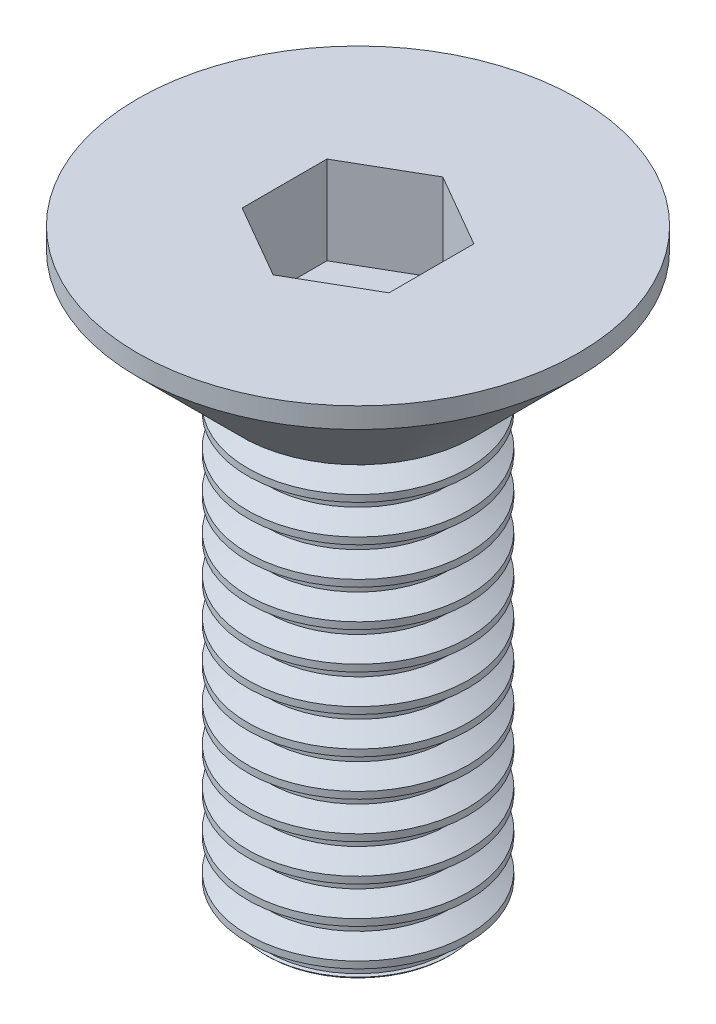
ISO-10303-21;
HEADER;
FILE_DESCRIPTION(('STEP AP214'),'2;1');
FILE_NAME('part.step','',(''),(''),'','','');
FILE_SCHEMA(('AUTOMOTIVE_DESIGN { 1 0 10303 214 1 1 1 1 }'));
ENDSEC;
DATA;
#1=APPLICATION_CONTEXT('core data for automotive mechanical design processes');
#2=APPLICATION_PROTOCOL_DEFINITION('international standard','automotive_design',2000,#1);
#3=PRODUCT_CONTEXT('',#1,'mechanical');
#4=PRODUCT('Part','Part','',(#3));
#5=PRODUCT_RELATED_PRODUCT_CATEGORY('part','',(#4));
#6=PRODUCT_DEFINITION_FORMATION('','',#4);
#7=PRODUCT_DEFINITION_CONTEXT('part definition',#1,'design');
#8=PRODUCT_DEFINITION('design','',#6,#7);
#9=PRODUCT_DEFINITION_SHAPE('','',#8);
#10=(LENGTH_UNIT() NAMED_UNIT(*) SI_UNIT(.MILLI.,.METRE.));
#11=(NAMED_UNIT(*) PLANE_ANGLE_UNIT() SI_UNIT($,.RADIAN.));
#12=(NAMED_UNIT(*) SI_UNIT($,.STERADIAN.) SOLID_ANGLE_UNIT());
#13=UNCERTAINTY_MEASURE_WITH_UNIT(LENGTH_MEASURE(1.E-05),#10,'distance_accuracy_value','');
#14=(GEOMETRIC_REPRESENTATION_CONTEXT(3) GLOBAL_UNCERTAINTY_ASSIGNED_CONTEXT((#13)) GLOBAL_UNIT_ASSIGNED_CONTEXT((#10,
#11,#12)) REPRESENTATION_CONTEXT('',''));
#15=CARTESIAN_POINT('',(0.,0.,0.));
#16=DIRECTION('',(0.,0.,1.));
#17=DIRECTION('',(1.,0.,0.));
#18=AXIS2_PLACEMENT_3D('',#15,#16,#17);
#19=CARTESIAN_POINT('',(0.,0.,0.));
#20=DIRECTION('',(0.,-1.,0.));
#21=DIRECTION('',(1.,0.,0.));
#22=AXIS2_PLACEMENT_3D('',#19,#20,#21);
#23=PLANE('',#22);
#24=DIRECTION('',(0.866025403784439,0.,0.5));
#25=VECTOR('',#24,1.);
#26=CARTESIAN_POINT('',(-1.,0.,0.577350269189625));
#27=LINE('',#26,#25);
#28=CARTESIAN_POINT('',(-1.,0.,0.577350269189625));
#29=VERTEX_POINT('',#28);
#30=CARTESIAN_POINT('',(0.,0.,1.15470053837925));
#31=VERTEX_POINT('',#30);
#32=EDGE_CURVE('E120',#29,#31,#27,.T.);
#33=ORIENTED_EDGE('',*,*,#32,.F.);
#34=DIRECTION('',(0.,0.,1.));
#35=VECTOR('',#34,1.);
#36=CARTESIAN_POINT('',(-1.,0.,-0.577350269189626));
#37=LINE('',#36,#35);
#38=CARTESIAN_POINT('',(-1.,0.,-0.577350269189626));
#39=VERTEX_POINT('',#38);
#40=EDGE_CURVE('E114',#39,#29,#37,.T.);
#41=ORIENTED_EDGE('',*,*,#40,.F.);
#42=DIRECTION('',(-0.866025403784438,0.,0.5));
#43=VECTOR('',#42,1.);
#44=CARTESIAN_POINT('',(0.,0.,-1.15470053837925));
#45=LINE('',#44,#43);
#46=CARTESIAN_POINT('',(0.,0.,-1.15470053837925));
#47=VERTEX_POINT('',#46);
#48=EDGE_CURVE('E112',#47,#39,#45,.T.);
#49=ORIENTED_EDGE('',*,*,#48,.F.);
#50=DIRECTION('',(-0.866025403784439,0.,-0.5));
#51=VECTOR('',#50,1.);
#52=CARTESIAN_POINT('',(1.,0.,-0.577350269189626));
#53=LINE('',#52,#51);
#54=CARTESIAN_POINT('',(1.,0.,-0.577350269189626));
#55=VERTEX_POINT('',#54);
#56=EDGE_CURVE('E93',#55,#47,#53,.T.);
#57=ORIENTED_EDGE('',*,*,#56,.F.);
#58=DIRECTION('',(0.,0.,-1.));
#59=VECTOR('',#58,1.);
#60=CARTESIAN_POINT('',(1.,0.,0.577350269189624));
#61=LINE('',#60,#59);
#62=CARTESIAN_POINT('',(1.,0.,0.577350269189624));
#63=VERTEX_POINT('',#62);
#64=EDGE_CURVE('E104',#63,#55,#61,.T.);
#65=ORIENTED_EDGE('',*,*,#64,.F.);
#66=DIRECTION('',(0.866025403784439,0.,-0.5));
#67=VECTOR('',#66,1.);
#68=CARTESIAN_POINT('',(0.,0.,1.15470053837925));
#69=LINE('',#68,#67);
#70=EDGE_CURVE('E50',#31,#63,#69,.T.);
#71=ORIENTED_EDGE('',*,*,#70,.F.);
#72=EDGE_LOOP('',(#33,#41,#49,#57,#65,#71));
#73=FACE_BOUND('',#72,.T.);
#74=CARTESIAN_POINT('',(0.,0.,0.));
#75=DIRECTION('',(0.,1.,0.));
#76=DIRECTION('',(-1.,0.,0.));
#77=AXIS2_PLACEMENT_3D('',#74,#75,#76);
#78=CIRCLE('',#77,3.);
#79=CARTESIAN_POINT('',(-3.,0.,0.));
#80=VERTEX_POINT('',#79);
#81=EDGE_CURVE('E11',#80,#80,#78,.T.);
#82=ORIENTED_EDGE('',*,*,#81,.T.);
#83=EDGE_LOOP('',(#82));
#84=FACE_BOUND('',#83,.T.);
#85=ADVANCED_FACE('F35',(#73,#84),#23,.F.);
#86=CARTESIAN_POINT('',(0.,0.,0.));
#87=DIRECTION('',(0.,1.,0.));
#88=DIRECTION('',(-1.,0.,0.));
#89=AXIS2_PLACEMENT_3D('',#86,#87,#88);
#90=CYLINDRICAL_SURFACE('',#89,3.);
#91=ORIENTED_EDGE('',*,*,#81,.F.);
#92=EDGE_LOOP('',(#91));
#93=FACE_BOUND('',#92,.T.);
#94=CARTESIAN_POINT('',(0.,-0.280000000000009,0.));
#95=DIRECTION('',(0.,1.,0.));
#96=DIRECTION('',(-1.,0.,0.));
#97=AXIS2_PLACEMENT_3D('',#94,#95,#96);
#98=CIRCLE('',#97,3.);
#99=CARTESIAN_POINT('',(-3.,-0.28000000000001,0.));
#100=VERTEX_POINT('',#99);
#101=EDGE_CURVE('E43',#100,#100,#98,.T.);
#102=ORIENTED_EDGE('',*,*,#101,.T.);
#103=EDGE_LOOP('',(#102));
#104=FACE_BOUND('',#103,.T.);
#105=ADVANCED_FACE('F154',(#93,#104),#90,.T.);
#106=CARTESIAN_POINT('',(0.,-1.69999999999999,0.));
#107=DIRECTION('',(0.,1.,0.));
#108=DIRECTION('',(-1.,0.,0.));
#109=AXIS2_PLACEMENT_3D('',#106,#107,#108);
#110=CONICAL_SURFACE('',#109,1.58000000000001,0.78539816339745);
#111=ORIENTED_EDGE('',*,*,#101,.F.);
#112=EDGE_LOOP('',(#111));
#113=FACE_BOUND('',#112,.T.);
#114=CARTESIAN_POINT('',(0.,-1.69999999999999,0.));
#115=DIRECTION('',(0.,1.,0.));
#116=DIRECTION('',(-1.,0.,0.));
#117=AXIS2_PLACEMENT_3D('',#114,#115,#116);
#118=CIRCLE('',#117,1.58000000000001);
#119=CARTESIAN_POINT('',(-1.58000000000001,-1.69999999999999,0.));
#120=VERTEX_POINT('',#119);
#121=EDGE_CURVE('E148',#120,#120,#118,.T.);
#122=ORIENTED_EDGE('',*,*,#121,.T.);
#123=EDGE_LOOP('',(#122));
#124=FACE_BOUND('',#123,.T.);
#125=ADVANCED_FACE('F156',(#113,#124),#110,.T.);
#126=CARTESIAN_POINT('',(1.50000000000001,-1.69999999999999,0.));
#127=DIRECTION('',(0.,1.,0.));
#128=DIRECTION('',(-1.,0.,0.));
#129=AXIS2_PLACEMENT_3D('',#126,#127,#128);
#130=PLANE('',#129);
#131=ORIENTED_EDGE('',*,*,#121,.F.);
#132=EDGE_LOOP('',(#131));
#133=FACE_BOUND('',#132,.T.);
#134=CARTESIAN_POINT('',(0.,-1.69999999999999,0.));
#135=DIRECTION('',(0.,-1.,0.));
#136=DIRECTION('',(1.,0.,0.));
#137=AXIS2_PLACEMENT_3D('',#134,#135,#136);
#138=CIRCLE('',#137,1.50000000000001);
#139=CARTESIAN_POINT('',(1.50000000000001,-1.69999999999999,0.));
#140=VERTEX_POINT('',#139);
#141=EDGE_CURVE('E169',#140,#140,#138,.T.);
#142=ORIENTED_EDGE('',*,*,#141,.F.);
#143=EDGE_LOOP('',(#142));
#144=FACE_BOUND('',#143,.T.);
#145=ADVANCED_FACE('F159',(#133,#144),#130,.F.);
#146=CARTESIAN_POINT('',(0.,-1.2,1.15470053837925));
#147=DIRECTION('',(0.5,0.,0.866025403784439));
#148=DIRECTION('',(0.866025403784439,0.,-0.5));
#149=AXIS2_PLACEMENT_3D('',#146,#147,#148);
#150=PLANE('',#149);
#151=ORIENTED_EDGE('',*,*,#70,.T.);
#152=DIRECTION('',(0.,1.,0.));
#153=VECTOR('',#152,1.);
#154=CARTESIAN_POINT('',(1.,-1.2,0.577350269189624));
#155=LINE('',#154,#153);
#156=CARTESIAN_POINT('',(1.,-1.2,0.577350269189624));
#157=VERTEX_POINT('',#156);
#158=EDGE_CURVE('E101',#157,#63,#155,.T.);
#159=ORIENTED_EDGE('',*,*,#158,.F.);
#160=DIRECTION('',(0.866025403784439,0.,-0.5));
#161=VECTOR('',#160,1.);
#162=CARTESIAN_POINT('',(0.,-1.2,1.15470053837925));
#163=LINE('',#162,#161);
#164=CARTESIAN_POINT('',(0.,-1.2,1.15470053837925));
#165=VERTEX_POINT('',#164);
#166=EDGE_CURVE('E122',#165,#157,#163,.T.);
#167=ORIENTED_EDGE('',*,*,#166,.F.);
#168=DIRECTION('',(0.,1.,0.));
#169=VECTOR('',#168,1.);
#170=CARTESIAN_POINT('',(0.,-1.2,1.15470053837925));
#171=LINE('',#170,#169);
#172=EDGE_CURVE('E57',#165,#31,#171,.T.);
#173=ORIENTED_EDGE('',*,*,#172,.T.);
#174=EDGE_LOOP('',(#151,#159,#167,#173));
#175=FACE_BOUND('',#174,.T.);
#176=ADVANCED_FACE('F165',(#175),#150,.F.);
#177=CARTESIAN_POINT('',(-1.,-1.2,0.577350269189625));
#178=DIRECTION('',(-0.5,0.,0.866025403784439));
#179=DIRECTION('',(0.866025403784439,0.,0.5));
#180=AXIS2_PLACEMENT_3D('',#177,#178,#179);
#181=PLANE('',#180);
#182=ORIENTED_EDGE('',*,*,#32,.T.);
#183=ORIENTED_EDGE('',*,*,#172,.F.);
#184=DIRECTION('',(0.866025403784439,0.,0.5));
#185=VECTOR('',#184,1.);
#186=CARTESIAN_POINT('',(-1.,-1.2,0.577350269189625));
#187=LINE('',#186,#185);
#188=CARTESIAN_POINT('',(-1.,-1.2,0.577350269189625));
#189=VERTEX_POINT('',#188);
#190=EDGE_CURVE('E134',#189,#165,#187,.T.);
#191=ORIENTED_EDGE('',*,*,#190,.F.);
#192=DIRECTION('',(0.,1.,0.));
#193=VECTOR('',#192,1.);
#194=CARTESIAN_POINT('',(-1.,-1.2,0.577350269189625));
#195=LINE('',#194,#193);
#196=EDGE_CURVE('E139',#189,#29,#195,.T.);
#197=ORIENTED_EDGE('',*,*,#196,.T.);
#198=EDGE_LOOP('',(#182,#183,#191,#197));
#199=FACE_BOUND('',#198,.T.);
#200=ADVANCED_FACE('F235',(#199),#181,.F.);
#201=CARTESIAN_POINT('',(-1.,-1.2,-0.577350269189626));
#202=DIRECTION('',(-1.,0.,0.));
#203=DIRECTION('',(0.,0.,1.));
#204=AXIS2_PLACEMENT_3D('',#201,#202,#203);
#205=PLANE('',#204);
#206=ORIENTED_EDGE('',*,*,#40,.T.);
#207=ORIENTED_EDGE('',*,*,#196,.F.);
#208=DIRECTION('',(0.,0.,1.));
#209=VECTOR('',#208,1.);
#210=CARTESIAN_POINT('',(-1.,-1.2,-0.577350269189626));
#211=LINE('',#210,#209);
#212=CARTESIAN_POINT('',(-1.,-1.2,-0.577350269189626));
#213=VERTEX_POINT('',#212);
#214=EDGE_CURVE('E131',#213,#189,#211,.T.);
#215=ORIENTED_EDGE('',*,*,#214,.F.);
#216=DIRECTION('',(0.,1.,0.));
#217=VECTOR('',#216,1.);
#218=CARTESIAN_POINT('',(-1.,-1.2,-0.577350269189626));
#219=LINE('',#218,#217);
#220=EDGE_CURVE('E141',#213,#39,#219,.T.);
#221=ORIENTED_EDGE('',*,*,#220,.T.);
#222=EDGE_LOOP('',(#206,#207,#215,#221));
#223=FACE_BOUND('',#222,.T.);
#224=ADVANCED_FACE('F243',(#223),#205,.F.);
#225=CARTESIAN_POINT('',(0.,-1.2,-1.15470053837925));
#226=DIRECTION('',(-0.5,0.,-0.866025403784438));
#227=DIRECTION('',(-0.866025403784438,0.,0.5));
#228=AXIS2_PLACEMENT_3D('',#225,#226,#227);
#229=PLANE('',#228);
#230=ORIENTED_EDGE('',*,*,#48,.T.);
#231=ORIENTED_EDGE('',*,*,#220,.F.);
#232=DIRECTION('',(-0.866025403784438,0.,0.5));
#233=VECTOR('',#232,1.);
#234=CARTESIAN_POINT('',(0.,-1.2,-1.15470053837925));
#235=LINE('',#234,#233);
#236=CARTESIAN_POINT('',(0.,-1.2,-1.15470053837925));
#237=VERTEX_POINT('',#236);
#238=EDGE_CURVE('E128',#237,#213,#235,.T.);
#239=ORIENTED_EDGE('',*,*,#238,.F.);
#240=DIRECTION('',(0.,1.,0.));
#241=VECTOR('',#240,1.);
#242=CARTESIAN_POINT('',(0.,-1.2,-1.15470053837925));
#243=LINE('',#242,#241);
#244=EDGE_CURVE('E100',#237,#47,#243,.T.);
#245=ORIENTED_EDGE('',*,*,#244,.T.);
#246=EDGE_LOOP('',(#230,#231,#239,#245));
#247=FACE_BOUND('',#246,.T.);
#248=ADVANCED_FACE('F240',(#247),#229,.F.);
#249=CARTESIAN_POINT('',(1.,-1.2,-0.577350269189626));
#250=DIRECTION('',(0.5,0.,-0.866025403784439));
#251=DIRECTION('',(-0.866025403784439,0.,-0.5));
#252=AXIS2_PLACEMENT_3D('',#249,#250,#251);
#253=PLANE('',#252);
#254=ORIENTED_EDGE('',*,*,#56,.T.);
#255=ORIENTED_EDGE('',*,*,#244,.F.);
#256=DIRECTION('',(-0.866025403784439,0.,-0.5));
#257=VECTOR('',#256,1.);
#258=CARTESIAN_POINT('',(1.,-1.2,-0.577350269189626));
#259=LINE('',#258,#257);
#260=CARTESIAN_POINT('',(1.,-1.2,-0.577350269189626));
#261=VERTEX_POINT('',#260);
#262=EDGE_CURVE('E96',#261,#237,#259,.T.);
#263=ORIENTED_EDGE('',*,*,#262,.F.);
#264=DIRECTION('',(0.,1.,0.));
#265=VECTOR('',#264,1.);
#266=CARTESIAN_POINT('',(1.,-1.2,-0.577350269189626));
#267=LINE('',#266,#265);
#268=EDGE_CURVE('E89',#261,#55,#267,.T.);
#269=ORIENTED_EDGE('',*,*,#268,.T.);
#270=EDGE_LOOP('',(#254,#255,#263,#269));
#271=FACE_BOUND('',#270,.T.);
#272=ADVANCED_FACE('F91',(#271),#253,.F.);
#273=CARTESIAN_POINT('',(1.,-1.2,0.577350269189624));
#274=DIRECTION('',(1.,0.,0.));
#275=DIRECTION('',(0.,0.,-1.));
#276=AXIS2_PLACEMENT_3D('',#273,#274,#275);
#277=PLANE('',#276);
#278=ORIENTED_EDGE('',*,*,#64,.T.);
#279=ORIENTED_EDGE('',*,*,#268,.F.);
#280=DIRECTION('',(0.,0.,-1.));
#281=VECTOR('',#280,1.);
#282=CARTESIAN_POINT('',(1.,-1.2,0.577350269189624));
#283=LINE('',#282,#281);
#284=EDGE_CURVE('E125',#157,#261,#283,.T.);
#285=ORIENTED_EDGE('',*,*,#284,.F.);
#286=ORIENTED_EDGE('',*,*,#158,.T.);
#287=EDGE_LOOP('',(#278,#279,#285,#286));
#288=FACE_BOUND('',#287,.T.);
#289=ADVANCED_FACE('F105',(#288),#277,.F.);
#290=CARTESIAN_POINT('',(-1.,-1.2,1.73205080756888));
#291=DIRECTION('',(0.,-1.,0.));
#292=DIRECTION('',(0.,0.,-1.));
#293=AXIS2_PLACEMENT_3D('',#290,#291,#292);
#294=PLANE('',#293);
#295=ORIENTED_EDGE('',*,*,#166,.T.);
#296=ORIENTED_EDGE('',*,*,#284,.T.);
#297=ORIENTED_EDGE('',*,*,#262,.T.);
#298=ORIENTED_EDGE('',*,*,#238,.T.);
#299=ORIENTED_EDGE('',*,*,#214,.T.);
#300=ORIENTED_EDGE('',*,*,#190,.T.);
#301=EDGE_LOOP('',(#295,#296,#297,#298,#299,#300));
#302=FACE_BOUND('',#301,.T.);
#303=ADVANCED_FACE('F194',(#302),#294,.F.);
#304=CARTESIAN_POINT('',(0.,-1.95000000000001,0.));
#305=DIRECTION('',(0.,-1.,0.));
#306=DIRECTION('',(1.,0.,0.));
#307=AXIS2_PLACEMENT_3D('',#304,#305,#306);
#308=CONICAL_SURFACE('',#307,1.22698729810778,1.04719755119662);
#309=CARTESIAN_POINT('',(0.,-2.10762395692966,0.));
#310=DIRECTION('',(0.,-1.,0.));
#311=DIRECTION('',(1.,0.,0.));
#312=AXIS2_PLACEMENT_3D('',#309,#310,#311);
#313=CIRCLE('',#312,1.50000000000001);
#314=CARTESIAN_POINT('',(1.50000000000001,-2.10762395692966,0.));
#315=VERTEX_POINT('',#314);
#316=EDGE_CURVE('E184',#315,#315,#313,.T.);
#317=ORIENTED_EDGE('',*,*,#316,.F.);
#318=EDGE_LOOP('',(#317));
#319=FACE_BOUND('',#318,.T.);
#320=CARTESIAN_POINT('',(0.,-1.95000000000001,0.));
#321=DIRECTION('',(0.,-1.,0.));
#322=DIRECTION('',(1.,0.,0.));
#323=AXIS2_PLACEMENT_3D('',#320,#321,#322);
#324=CIRCLE('',#323,1.22698729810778);
#325=CARTESIAN_POINT('',(1.22698729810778,-1.95000000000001,0.));
#326=VERTEX_POINT('',#325);
#327=EDGE_CURVE('E175',#326,#326,#324,.T.);
#328=ORIENTED_EDGE('',*,*,#327,.T.);
#329=EDGE_LOOP('',(#328));
#330=FACE_BOUND('',#329,.T.);
#331=ADVANCED_FACE('F190',(#319,#330),#308,.T.);
#332=CARTESIAN_POINT('',(0.,-8.,0.));
#333=DIRECTION('',(0.,-1.,0.));
#334=DIRECTION('',(1.,0.,0.));
#335=AXIS2_PLACEMENT_3D('',#332,#333,#334);
#336=CYLINDRICAL_SURFACE('',#335,1.22698729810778);
#337=ORIENTED_EDGE('',*,*,#327,.F.);
#338=EDGE_LOOP('',(#337));
#339=FACE_BOUND('',#338,.T.);
#340=CARTESIAN_POINT('',(0.,-1.85762395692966,0.));
#341=DIRECTION('',(0.,-1.,0.));
#342=DIRECTION('',(1.,0.,0.));
#343=AXIS2_PLACEMENT_3D('',#340,#341,#342);
#344=CIRCLE('',#343,1.22698729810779);
#345=CARTESIAN_POINT('',(1.22698729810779,-1.85762395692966,0.));
#346=VERTEX_POINT('',#345);
#347=EDGE_CURVE('E171',#346,#346,#344,.T.);
#348=ORIENTED_EDGE('',*,*,#347,.T.);
#349=EDGE_LOOP('',(#348));
#350=FACE_BOUND('',#349,.T.);
#351=ADVANCED_FACE('F193',(#339,#350),#336,.T.);
#352=CARTESIAN_POINT('',(0.,-1.69999999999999,0.));
#353=DIRECTION('',(0.,1.,0.));
#354=DIRECTION('',(-1.,0.,0.));
#355=AXIS2_PLACEMENT_3D('',#352,#353,#354);
#356=CONICAL_SURFACE('',#355,1.50000000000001,1.04719755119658);
#357=ORIENTED_EDGE('',*,*,#347,.F.);
#358=EDGE_LOOP('',(#357));
#359=FACE_BOUND('',#358,.T.);
#360=ORIENTED_EDGE('',*,*,#141,.T.);
#361=EDGE_LOOP('',(#360));
#362=FACE_BOUND('',#361,.T.);
#363=ADVANCED_FACE('F200',(#359,#362),#356,.T.);
#364=CARTESIAN_POINT('',(0.,0.,0.));
#365=DIRECTION('',(0.,1.,0.));
#366=DIRECTION('',(-1.,0.,0.));
#367=AXIS2_PLACEMENT_3D('',#364,#365,#366);
#368=CYLINDRICAL_SURFACE('',#367,1.5);
#369=CARTESIAN_POINT('',(0.,-2.19999999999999,0.));
#370=DIRECTION('',(0.,-1.,0.));
#371=DIRECTION('',(1.,0.,0.));
#372=AXIS2_PLACEMENT_3D('',#369,#370,#371);
#373=CIRCLE('',#372,1.50000000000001);
#374=CARTESIAN_POINT('',(1.50000000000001,-2.19999999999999,0.));
#375=VERTEX_POINT('',#374);
#376=EDGE_CURVE('E949',#375,#375,#373,.T.);
#377=ORIENTED_EDGE('',*,*,#376,.F.);
#378=EDGE_LOOP('',(#377));
#379=FACE_BOUND('',#378,.T.);
#380=ORIENTED_EDGE('',*,*,#316,.T.);
#381=EDGE_LOOP('',(#380));
#382=FACE_BOUND('',#381,.T.);
#383=ADVANCED_FACE('F188',(#379,#382),#368,.T.);
#384=CARTESIAN_POINT('',(0.,-2.45000000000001,0.));
#385=DIRECTION('',(0.,-1.,0.));
#386=DIRECTION('',(1.,0.,0.));
#387=AXIS2_PLACEMENT_3D('',#384,#385,#386);
#388=CONICAL_SURFACE('',#387,1.22698729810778,1.04719755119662);
#389=CARTESIAN_POINT('',(0.,-2.60762395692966,0.));
#390=DIRECTION('',(0.,-1.,0.));
#391=DIRECTION('',(1.,0.,0.));
#392=AXIS2_PLACEMENT_3D('',#389,#390,#391);
#393=CIRCLE('',#392,1.50000000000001);
#394=CARTESIAN_POINT('',(1.50000000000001,-2.60762395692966,0.));
#395=VERTEX_POINT('',#394);
#396=EDGE_CURVE('E172',#395,#395,#393,.T.);
#397=ORIENTED_EDGE('',*,*,#396,.F.);
#398=EDGE_LOOP('',(#397));
#399=FACE_BOUND('',#398,.T.);
#400=CARTESIAN_POINT('',(0.,-2.45000000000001,0.));
#401=DIRECTION('',(0.,-1.,0.));
#402=DIRECTION('',(1.,0.,0.));
#403=AXIS2_PLACEMENT_3D('',#400,#401,#402);
#404=CIRCLE('',#403,1.22698729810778);
#405=CARTESIAN_POINT('',(1.22698729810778,-2.45000000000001,0.));
#406=VERTEX_POINT('',#405);
#407=EDGE_CURVE('E178',#406,#406,#404,.T.);
#408=ORIENTED_EDGE('',*,*,#407,.T.);
#409=EDGE_LOOP('',(#408));
#410=FACE_BOUND('',#409,.T.);
#411=ADVANCED_FACE('F209',(#399,#410),#388,.T.);
#412=CARTESIAN_POINT('',(0.,-8.5,0.));
#413=DIRECTION('',(0.,-1.,0.));
#414=DIRECTION('',(1.,0.,0.));
#415=AXIS2_PLACEMENT_3D('',#412,#413,#414);
#416=CYLINDRICAL_SURFACE('',#415,1.22698729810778);
#417=ORIENTED_EDGE('',*,*,#407,.F.);
#418=EDGE_LOOP('',(#417));
#419=FACE_BOUND('',#418,.T.);
#420=CARTESIAN_POINT('',(0.,-2.35762395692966,0.));
#421=DIRECTION('',(0.,-1.,0.));
#422=DIRECTION('',(1.,0.,0.));
#423=AXIS2_PLACEMENT_3D('',#420,#421,#422);
#424=CIRCLE('',#423,1.22698729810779);
#425=CARTESIAN_POINT('',(1.22698729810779,-2.35762395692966,0.));
#426=VERTEX_POINT('',#425);
#427=EDGE_CURVE('E952',#426,#426,#424,.T.);
#428=ORIENTED_EDGE('',*,*,#427,.T.);
#429=EDGE_LOOP('',(#428));
#430=FACE_BOUND('',#429,.T.);
#431=ADVANCED_FACE('F288',(#419,#430),#416,.T.);
#432=CARTESIAN_POINT('',(0.,-2.19999999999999,0.));
#433=DIRECTION('',(0.,1.,0.));
#434=DIRECTION('',(-1.,0.,0.));
#435=AXIS2_PLACEMENT_3D('',#432,#433,#434);
#436=CONICAL_SURFACE('',#435,1.50000000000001,1.04719755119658);
#437=ORIENTED_EDGE('',*,*,#427,.F.);
#438=EDGE_LOOP('',(#437));
#439=FACE_BOUND('',#438,.T.);
#440=ORIENTED_EDGE('',*,*,#376,.T.);
#441=EDGE_LOOP('',(#440));
#442=FACE_BOUND('',#441,.T.);
#443=ADVANCED_FACE('F298',(#439,#442),#436,.T.);
#444=CARTESIAN_POINT('',(0.,-2.69999999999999,0.));
#445=DIRECTION('',(0.,-1.,0.));
#446=DIRECTION('',(1.,0.,0.));
#447=AXIS2_PLACEMENT_3D('',#444,#445,#446);
#448=CIRCLE('',#447,1.50000000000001);
#449=CARTESIAN_POINT('',(1.50000000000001,-2.69999999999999,0.));
#450=VERTEX_POINT('',#449);
#451=EDGE_CURVE('E937',#450,#450,#448,.T.);
#452=ORIENTED_EDGE('',*,*,#451,.F.);
#453=EDGE_LOOP('',(#452));
#454=FACE_BOUND('',#453,.T.);
#455=ORIENTED_EDGE('',*,*,#396,.T.);
#456=EDGE_LOOP('',(#455));
#457=FACE_BOUND('',#456,.T.);
#458=ADVANCED_FACE('F213',(#454,#457),#368,.T.);
#459=CARTESIAN_POINT('',(0.,-2.95000000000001,0.));
#460=DIRECTION('',(0.,-1.,0.));
#461=DIRECTION('',(1.,0.,0.));
#462=AXIS2_PLACEMENT_3D('',#459,#460,#461);
#463=CONICAL_SURFACE('',#462,1.22698729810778,1.04719755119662);
#464=CARTESIAN_POINT('',(0.,-3.10762395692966,0.));
#465=DIRECTION('',(0.,-1.,0.));
#466=DIRECTION('',(1.,0.,0.));
#467=AXIS2_PLACEMENT_3D('',#464,#465,#466);
#468=CIRCLE('',#467,1.50000000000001);
#469=CARTESIAN_POINT('',(1.50000000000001,-3.10762395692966,0.));
#470=VERTEX_POINT('',#469);
#471=EDGE_CURVE('E946',#470,#470,#468,.T.);
#472=ORIENTED_EDGE('',*,*,#471,.F.);
#473=EDGE_LOOP('',(#472));
#474=FACE_BOUND('',#473,.T.);
#475=CARTESIAN_POINT('',(0.,-2.95000000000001,0.));
#476=DIRECTION('',(0.,-1.,0.));
#477=DIRECTION('',(1.,0.,0.));
#478=AXIS2_PLACEMENT_3D('',#475,#476,#477);
#479=CIRCLE('',#478,1.22698729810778);
#480=CARTESIAN_POINT('',(1.22698729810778,-2.95000000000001,0.));
#481=VERTEX_POINT('',#480);
#482=EDGE_CURVE('E943',#481,#481,#479,.T.);
#483=ORIENTED_EDGE('',*,*,#482,.T.);
#484=EDGE_LOOP('',(#483));
#485=FACE_BOUND('',#484,.T.);
#486=ADVANCED_FACE('F318',(#474,#485),#463,.T.);
#487=CARTESIAN_POINT('',(0.,-9.,0.));
#488=DIRECTION('',(0.,-1.,0.));
#489=DIRECTION('',(1.,0.,0.));
#490=AXIS2_PLACEMENT_3D('',#487,#488,#489);
#491=CYLINDRICAL_SURFACE('',#490,1.22698729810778);
#492=ORIENTED_EDGE('',*,*,#482,.F.);
#493=EDGE_LOOP('',(#492));
#494=FACE_BOUND('',#493,.T.);
#495=CARTESIAN_POINT('',(0.,-2.85762395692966,0.));
#496=DIRECTION('',(0.,-1.,0.));
#497=DIRECTION('',(1.,0.,0.));
#498=AXIS2_PLACEMENT_3D('',#495,#496,#497);
#499=CIRCLE('',#498,1.22698729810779);
#500=CARTESIAN_POINT('',(1.22698729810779,-2.85762395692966,0.));
#501=VERTEX_POINT('',#500);
#502=EDGE_CURVE('E940',#501,#501,#499,.T.);
#503=ORIENTED_EDGE('',*,*,#502,.T.);
#504=EDGE_LOOP('',(#503));
#505=FACE_BOUND('',#504,.T.);
#506=ADVANCED_FACE('F328',(#494,#505),#491,.T.);
#507=CARTESIAN_POINT('',(0.,-2.69999999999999,0.));
#508=DIRECTION('',(0.,1.,0.));
#509=DIRECTION('',(-1.,0.,0.));
#510=AXIS2_PLACEMENT_3D('',#507,#508,#509);
#511=CONICAL_SURFACE('',#510,1.50000000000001,1.04719755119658);
#512=ORIENTED_EDGE('',*,*,#502,.F.);
#513=EDGE_LOOP('',(#512));
#514=FACE_BOUND('',#513,.T.);
#515=ORIENTED_EDGE('',*,*,#451,.T.);
#516=EDGE_LOOP('',(#515));
#517=FACE_BOUND('',#516,.T.);
#518=ADVANCED_FACE('F338',(#514,#517),#511,.T.);
#519=CARTESIAN_POINT('',(0.,-3.19999999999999,0.));
#520=DIRECTION('',(0.,-1.,0.));
#521=DIRECTION('',(1.,0.,0.));
#522=AXIS2_PLACEMENT_3D('',#519,#520,#521);
#523=CIRCLE('',#522,1.50000000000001);
#524=CARTESIAN_POINT('',(1.50000000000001,-3.19999999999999,0.));
#525=VERTEX_POINT('',#524);
#526=EDGE_CURVE('E925',#525,#525,#523,.T.);
#527=ORIENTED_EDGE('',*,*,#526,.F.);
#528=EDGE_LOOP('',(#527));
#529=FACE_BOUND('',#528,.T.);
#530=ORIENTED_EDGE('',*,*,#471,.T.);
#531=EDGE_LOOP('',(#530));
#532=FACE_BOUND('',#531,.T.);
#533=ADVANCED_FACE('F320',(#529,#532),#368,.T.);
#534=CARTESIAN_POINT('',(0.,-3.45000000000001,0.));
#535=DIRECTION('',(0.,-1.,0.));
#536=DIRECTION('',(1.,0.,0.));
#537=AXIS2_PLACEMENT_3D('',#534,#535,#536);
#538=CONICAL_SURFACE('',#537,1.22698729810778,1.04719755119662);
#539=CARTESIAN_POINT('',(0.,-3.60762395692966,0.));
#540=DIRECTION('',(0.,-1.,0.));
#541=DIRECTION('',(1.,0.,0.));
#542=AXIS2_PLACEMENT_3D('',#539,#540,#541);
#543=CIRCLE('',#542,1.50000000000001);
#544=CARTESIAN_POINT('',(1.50000000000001,-3.60762395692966,0.));
#545=VERTEX_POINT('',#544);
#546=EDGE_CURVE('E934',#545,#545,#543,.T.);
#547=ORIENTED_EDGE('',*,*,#546,.F.);
#548=EDGE_LOOP('',(#547));
#549=FACE_BOUND('',#548,.T.);
#550=CARTESIAN_POINT('',(0.,-3.45000000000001,0.));
#551=DIRECTION('',(0.,-1.,0.));
#552=DIRECTION('',(1.,0.,0.));
#553=AXIS2_PLACEMENT_3D('',#550,#551,#552);
#554=CIRCLE('',#553,1.22698729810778);
#555=CARTESIAN_POINT('',(1.22698729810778,-3.45000000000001,0.));
#556=VERTEX_POINT('',#555);
#557=EDGE_CURVE('E931',#556,#556,#554,.T.);
#558=ORIENTED_EDGE('',*,*,#557,.T.);
#559=EDGE_LOOP('',(#558));
#560=FACE_BOUND('',#559,.T.);
#561=ADVANCED_FACE('F357',(#549,#560),#538,.T.);
#562=CARTESIAN_POINT('',(0.,-9.5,0.));
#563=DIRECTION('',(0.,-1.,0.));
#564=DIRECTION('',(1.,0.,0.));
#565=AXIS2_PLACEMENT_3D('',#562,#563,#564);
#566=CYLINDRICAL_SURFACE('',#565,1.22698729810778);
#567=ORIENTED_EDGE('',*,*,#557,.F.);
#568=EDGE_LOOP('',(#567));
#569=FACE_BOUND('',#568,.T.);
#570=CARTESIAN_POINT('',(0.,-3.35762395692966,0.));
#571=DIRECTION('',(0.,-1.,0.));
#572=DIRECTION('',(1.,0.,0.));
#573=AXIS2_PLACEMENT_3D('',#570,#571,#572);
#574=CIRCLE('',#573,1.22698729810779);
#575=CARTESIAN_POINT('',(1.22698729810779,-3.35762395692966,0.));
#576=VERTEX_POINT('',#575);
#577=EDGE_CURVE('E928',#576,#576,#574,.T.);
#578=ORIENTED_EDGE('',*,*,#577,.T.);
#579=EDGE_LOOP('',(#578));
#580=FACE_BOUND('',#579,.T.);
#581=ADVANCED_FACE('F367',(#569,#580),#566,.T.);
#582=CARTESIAN_POINT('',(0.,-3.19999999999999,0.));
#583=DIRECTION('',(0.,1.,0.));
#584=DIRECTION('',(-1.,0.,0.));
#585=AXIS2_PLACEMENT_3D('',#582,#583,#584);
#586=CONICAL_SURFACE('',#585,1.50000000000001,1.04719755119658);
#587=ORIENTED_EDGE('',*,*,#577,.F.);
#588=EDGE_LOOP('',(#587));
#589=FACE_BOUND('',#588,.T.);
#590=ORIENTED_EDGE('',*,*,#526,.T.);
#591=EDGE_LOOP('',(#590));
#592=FACE_BOUND('',#591,.T.);
#593=ADVANCED_FACE('F377',(#589,#592),#586,.T.);
#594=CARTESIAN_POINT('',(0.,-3.69999999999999,0.));
#595=DIRECTION('',(0.,-1.,0.));
#596=DIRECTION('',(1.,0.,0.));
#597=AXIS2_PLACEMENT_3D('',#594,#595,#596);
#598=CIRCLE('',#597,1.50000000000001);
#599=CARTESIAN_POINT('',(1.50000000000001,-3.69999999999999,0.));
#600=VERTEX_POINT('',#599);
#601=EDGE_CURVE('E913',#600,#600,#598,.T.);
#602=ORIENTED_EDGE('',*,*,#601,.F.);
#603=EDGE_LOOP('',(#602));
#604=FACE_BOUND('',#603,.T.);
#605=ORIENTED_EDGE('',*,*,#546,.T.);
#606=EDGE_LOOP('',(#605));
#607=FACE_BOUND('',#606,.T.);
#608=ADVANCED_FACE('F359',(#604,#607),#368,.T.);
#609=CARTESIAN_POINT('',(0.,-3.95000000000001,0.));
#610=DIRECTION('',(0.,-1.,0.));
#611=DIRECTION('',(1.,0.,0.));
#612=AXIS2_PLACEMENT_3D('',#609,#610,#611);
#613=CONICAL_SURFACE('',#612,1.22698729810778,1.04719755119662);
#614=CARTESIAN_POINT('',(0.,-4.10762395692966,0.));
#615=DIRECTION('',(0.,-1.,0.));
#616=DIRECTION('',(1.,0.,0.));
#617=AXIS2_PLACEMENT_3D('',#614,#615,#616);
#618=CIRCLE('',#617,1.50000000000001);
#619=CARTESIAN_POINT('',(1.50000000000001,-4.10762395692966,0.));
#620=VERTEX_POINT('',#619);
#621=EDGE_CURVE('E922',#620,#620,#618,.T.);
#622=ORIENTED_EDGE('',*,*,#621,.F.);
#623=EDGE_LOOP('',(#622));
#624=FACE_BOUND('',#623,.T.);
#625=CARTESIAN_POINT('',(0.,-3.95000000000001,0.));
#626=DIRECTION('',(0.,-1.,0.));
#627=DIRECTION('',(1.,0.,0.));
#628=AXIS2_PLACEMENT_3D('',#625,#626,#627);
#629=CIRCLE('',#628,1.22698729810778);
#630=CARTESIAN_POINT('',(1.22698729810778,-3.95000000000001,0.));
#631=VERTEX_POINT('',#630);
#632=EDGE_CURVE('E919',#631,#631,#629,.T.);
#633=ORIENTED_EDGE('',*,*,#632,.T.);
#634=EDGE_LOOP('',(#633));
#635=FACE_BOUND('',#634,.T.);
#636=ADVANCED_FACE('F396',(#624,#635),#613,.T.);
#637=CARTESIAN_POINT('',(0.,-10.,0.));
#638=DIRECTION('',(0.,-1.,0.));
#639=DIRECTION('',(1.,0.,0.));
#640=AXIS2_PLACEMENT_3D('',#637,#638,#639);
#641=CYLINDRICAL_SURFACE('',#640,1.22698729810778);
#642=ORIENTED_EDGE('',*,*,#632,.F.);
#643=EDGE_LOOP('',(#642));
#644=FACE_BOUND('',#643,.T.);
#645=CARTESIAN_POINT('',(0.,-3.85762395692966,0.));
#646=DIRECTION('',(0.,-1.,0.));
#647=DIRECTION('',(1.,0.,0.));
#648=AXIS2_PLACEMENT_3D('',#645,#646,#647);
#649=CIRCLE('',#648,1.22698729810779);
#650=CARTESIAN_POINT('',(1.22698729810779,-3.85762395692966,0.));
#651=VERTEX_POINT('',#650);
#652=EDGE_CURVE('E916',#651,#651,#649,.T.);
#653=ORIENTED_EDGE('',*,*,#652,.T.);
#654=EDGE_LOOP('',(#653));
#655=FACE_BOUND('',#654,.T.);
#656=ADVANCED_FACE('F406',(#644,#655),#641,.T.);
#657=CARTESIAN_POINT('',(0.,-3.69999999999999,0.));
#658=DIRECTION('',(0.,1.,0.));
#659=DIRECTION('',(-1.,0.,0.));
#660=AXIS2_PLACEMENT_3D('',#657,#658,#659);
#661=CONICAL_SURFACE('',#660,1.50000000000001,1.04719755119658);
#662=ORIENTED_EDGE('',*,*,#652,.F.);
#663=EDGE_LOOP('',(#662));
#664=FACE_BOUND('',#663,.T.);
#665=ORIENTED_EDGE('',*,*,#601,.T.);
#666=EDGE_LOOP('',(#665));
#667=FACE_BOUND('',#666,.T.);
#668=ADVANCED_FACE('F416',(#664,#667),#661,.T.);
#669=CARTESIAN_POINT('',(0.,-4.19999999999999,0.));
#670=DIRECTION('',(0.,-1.,0.));
#671=DIRECTION('',(1.,0.,0.));
#672=AXIS2_PLACEMENT_3D('',#669,#670,#671);
#673=CIRCLE('',#672,1.50000000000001);
#674=CARTESIAN_POINT('',(1.50000000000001,-4.19999999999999,0.));
#675=VERTEX_POINT('',#674);
#676=EDGE_CURVE('E901',#675,#675,#673,.T.);
#677=ORIENTED_EDGE('',*,*,#676,.F.);
#678=EDGE_LOOP('',(#677));
#679=FACE_BOUND('',#678,.T.);
#680=ORIENTED_EDGE('',*,*,#621,.T.);
#681=EDGE_LOOP('',(#680));
#682=FACE_BOUND('',#681,.T.);
#683=ADVANCED_FACE('F398',(#679,#682),#368,.T.);
#684=CARTESIAN_POINT('',(0.,-4.45000000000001,0.));
#685=DIRECTION('',(0.,-1.,0.));
#686=DIRECTION('',(1.,0.,0.));
#687=AXIS2_PLACEMENT_3D('',#684,#685,#686);
#688=CONICAL_SURFACE('',#687,1.22698729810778,1.04719755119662);
#689=CARTESIAN_POINT('',(0.,-4.60762395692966,0.));
#690=DIRECTION('',(0.,-1.,0.));
#691=DIRECTION('',(1.,0.,0.));
#692=AXIS2_PLACEMENT_3D('',#689,#690,#691);
#693=CIRCLE('',#692,1.50000000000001);
#694=CARTESIAN_POINT('',(1.50000000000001,-4.60762395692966,0.));
#695=VERTEX_POINT('',#694);
#696=EDGE_CURVE('E910',#695,#695,#693,.T.);
#697=ORIENTED_EDGE('',*,*,#696,.F.);
#698=EDGE_LOOP('',(#697));
#699=FACE_BOUND('',#698,.T.);
#700=CARTESIAN_POINT('',(0.,-4.45000000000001,0.));
#701=DIRECTION('',(0.,-1.,0.));
#702=DIRECTION('',(1.,0.,0.));
#703=AXIS2_PLACEMENT_3D('',#700,#701,#702);
#704=CIRCLE('',#703,1.22698729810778);
#705=CARTESIAN_POINT('',(1.22698729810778,-4.45000000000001,0.));
#706=VERTEX_POINT('',#705);
#707=EDGE_CURVE('E907',#706,#706,#704,.T.);
#708=ORIENTED_EDGE('',*,*,#707,.T.);
#709=EDGE_LOOP('',(#708));
#710=FACE_BOUND('',#709,.T.);
#711=ADVANCED_FACE('F435',(#699,#710),#688,.T.);
#712=CARTESIAN_POINT('',(0.,-10.5,0.));
#713=DIRECTION('',(0.,-1.,0.));
#714=DIRECTION('',(1.,0.,0.));
#715=AXIS2_PLACEMENT_3D('',#712,#713,#714);
#716=CYLINDRICAL_SURFACE('',#715,1.22698729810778);
#717=ORIENTED_EDGE('',*,*,#707,.F.);
#718=EDGE_LOOP('',(#717));
#719=FACE_BOUND('',#718,.T.);
#720=CARTESIAN_POINT('',(0.,-4.35762395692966,0.));
#721=DIRECTION('',(0.,-1.,0.));
#722=DIRECTION('',(1.,0.,0.));
#723=AXIS2_PLACEMENT_3D('',#720,#721,#722);
#724=CIRCLE('',#723,1.22698729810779);
#725=CARTESIAN_POINT('',(1.22698729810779,-4.35762395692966,0.));
#726=VERTEX_POINT('',#725);
#727=EDGE_CURVE('E904',#726,#726,#724,.T.);
#728=ORIENTED_EDGE('',*,*,#727,.T.);
#729=EDGE_LOOP('',(#728));
#730=FACE_BOUND('',#729,.T.);
#731=ADVANCED_FACE('F445',(#719,#730),#716,.T.);
#732=CARTESIAN_POINT('',(0.,-4.19999999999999,0.));
#733=DIRECTION('',(0.,1.,0.));
#734=DIRECTION('',(-1.,0.,0.));
#735=AXIS2_PLACEMENT_3D('',#732,#733,#734);
#736=CONICAL_SURFACE('',#735,1.50000000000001,1.04719755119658);
#737=ORIENTED_EDGE('',*,*,#727,.F.);
#738=EDGE_LOOP('',(#737));
#739=FACE_BOUND('',#738,.T.);
#740=ORIENTED_EDGE('',*,*,#676,.T.);
#741=EDGE_LOOP('',(#740));
#742=FACE_BOUND('',#741,.T.);
#743=ADVANCED_FACE('F455',(#739,#742),#736,.T.);
#744=CARTESIAN_POINT('',(0.,-4.69999999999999,0.));
#745=DIRECTION('',(0.,-1.,0.));
#746=DIRECTION('',(1.,0.,0.));
#747=AXIS2_PLACEMENT_3D('',#744,#745,#746);
#748=CIRCLE('',#747,1.50000000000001);
#749=CARTESIAN_POINT('',(1.50000000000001,-4.69999999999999,0.));
#750=VERTEX_POINT('',#749);
#751=EDGE_CURVE('E889',#750,#750,#748,.T.);
#752=ORIENTED_EDGE('',*,*,#751,.F.);
#753=EDGE_LOOP('',(#752));
#754=FACE_BOUND('',#753,.T.);
#755=ORIENTED_EDGE('',*,*,#696,.T.);
#756=EDGE_LOOP('',(#755));
#757=FACE_BOUND('',#756,.T.);
#758=ADVANCED_FACE('F437',(#754,#757),#368,.T.);
#759=CARTESIAN_POINT('',(0.,-4.95000000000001,0.));
#760=DIRECTION('',(0.,-1.,0.));
#761=DIRECTION('',(1.,0.,0.));
#762=AXIS2_PLACEMENT_3D('',#759,#760,#761);
#763=CONICAL_SURFACE('',#762,1.22698729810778,1.04719755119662);
#764=CARTESIAN_POINT('',(0.,-5.10762395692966,0.));
#765=DIRECTION('',(0.,-1.,0.));
#766=DIRECTION('',(1.,0.,0.));
#767=AXIS2_PLACEMENT_3D('',#764,#765,#766);
#768=CIRCLE('',#767,1.50000000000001);
#769=CARTESIAN_POINT('',(1.50000000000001,-5.10762395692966,0.));
#770=VERTEX_POINT('',#769);
#771=EDGE_CURVE('E898',#770,#770,#768,.T.);
#772=ORIENTED_EDGE('',*,*,#771,.F.);
#773=EDGE_LOOP('',(#772));
#774=FACE_BOUND('',#773,.T.);
#775=CARTESIAN_POINT('',(0.,-4.95000000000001,0.));
#776=DIRECTION('',(0.,-1.,0.));
#777=DIRECTION('',(1.,0.,0.));
#778=AXIS2_PLACEMENT_3D('',#775,#776,#777);
#779=CIRCLE('',#778,1.22698729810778);
#780=CARTESIAN_POINT('',(1.22698729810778,-4.95000000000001,0.));
#781=VERTEX_POINT('',#780);
#782=EDGE_CURVE('E895',#781,#781,#779,.T.);
#783=ORIENTED_EDGE('',*,*,#782,.T.);
#784=EDGE_LOOP('',(#783));
#785=FACE_BOUND('',#784,.T.);
#786=ADVANCED_FACE('F474',(#774,#785),#763,.T.);
#787=CARTESIAN_POINT('',(0.,-11.,0.));
#788=DIRECTION('',(0.,-1.,0.));
#789=DIRECTION('',(1.,0.,0.));
#790=AXIS2_PLACEMENT_3D('',#787,#788,#789);
#791=CYLINDRICAL_SURFACE('',#790,1.22698729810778);
#792=ORIENTED_EDGE('',*,*,#782,.F.);
#793=EDGE_LOOP('',(#792));
#794=FACE_BOUND('',#793,.T.);
#795=CARTESIAN_POINT('',(0.,-4.85762395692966,0.));
#796=DIRECTION('',(0.,-1.,0.));
#797=DIRECTION('',(1.,0.,0.));
#798=AXIS2_PLACEMENT_3D('',#795,#796,#797);
#799=CIRCLE('',#798,1.22698729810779);
#800=CARTESIAN_POINT('',(1.22698729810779,-4.85762395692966,0.));
#801=VERTEX_POINT('',#800);
#802=EDGE_CURVE('E892',#801,#801,#799,.T.);
#803=ORIENTED_EDGE('',*,*,#802,.T.);
#804=EDGE_LOOP('',(#803));
#805=FACE_BOUND('',#804,.T.);
#806=ADVANCED_FACE('F484',(#794,#805),#791,.T.);
#807=CARTESIAN_POINT('',(0.,-4.69999999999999,0.));
#808=DIRECTION('',(0.,1.,0.));
#809=DIRECTION('',(-1.,0.,0.));
#810=AXIS2_PLACEMENT_3D('',#807,#808,#809);
#811=CONICAL_SURFACE('',#810,1.50000000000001,1.04719755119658);
#812=ORIENTED_EDGE('',*,*,#802,.F.);
#813=EDGE_LOOP('',(#812));
#814=FACE_BOUND('',#813,.T.);
#815=ORIENTED_EDGE('',*,*,#751,.T.);
#816=EDGE_LOOP('',(#815));
#817=FACE_BOUND('',#816,.T.);
#818=ADVANCED_FACE('F494',(#814,#817),#811,.T.);
#819=CARTESIAN_POINT('',(0.,-5.19999999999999,0.));
#820=DIRECTION('',(0.,-1.,0.));
#821=DIRECTION('',(1.,0.,0.));
#822=AXIS2_PLACEMENT_3D('',#819,#820,#821);
#823=CIRCLE('',#822,1.50000000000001);
#824=CARTESIAN_POINT('',(1.50000000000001,-5.19999999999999,0.));
#825=VERTEX_POINT('',#824);
#826=EDGE_CURVE('E877',#825,#825,#823,.T.);
#827=ORIENTED_EDGE('',*,*,#826,.F.);
#828=EDGE_LOOP('',(#827));
#829=FACE_BOUND('',#828,.T.);
#830=ORIENTED_EDGE('',*,*,#771,.T.);
#831=EDGE_LOOP('',(#830));
#832=FACE_BOUND('',#831,.T.);
#833=ADVANCED_FACE('F476',(#829,#832),#368,.T.);
#834=CARTESIAN_POINT('',(0.,-5.45000000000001,0.));
#835=DIRECTION('',(0.,-1.,0.));
#836=DIRECTION('',(1.,0.,0.));
#837=AXIS2_PLACEMENT_3D('',#834,#835,#836);
#838=CONICAL_SURFACE('',#837,1.22698729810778,1.04719755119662);
#839=CARTESIAN_POINT('',(0.,-5.60762395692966,0.));
#840=DIRECTION('',(0.,-1.,0.));
#841=DIRECTION('',(1.,0.,0.));
#842=AXIS2_PLACEMENT_3D('',#839,#840,#841);
#843=CIRCLE('',#842,1.50000000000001);
#844=CARTESIAN_POINT('',(1.50000000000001,-5.60762395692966,0.));
#845=VERTEX_POINT('',#844);
#846=EDGE_CURVE('E886',#845,#845,#843,.T.);
#847=ORIENTED_EDGE('',*,*,#846,.F.);
#848=EDGE_LOOP('',(#847));
#849=FACE_BOUND('',#848,.T.);
#850=CARTESIAN_POINT('',(0.,-5.45000000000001,0.));
#851=DIRECTION('',(0.,-1.,0.));
#852=DIRECTION('',(1.,0.,0.));
#853=AXIS2_PLACEMENT_3D('',#850,#851,#852);
#854=CIRCLE('',#853,1.22698729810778);
#855=CARTESIAN_POINT('',(1.22698729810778,-5.45000000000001,0.));
#856=VERTEX_POINT('',#855);
#857=EDGE_CURVE('E883',#856,#856,#854,.T.);
#858=ORIENTED_EDGE('',*,*,#857,.T.);
#859=EDGE_LOOP('',(#858));
#860=FACE_BOUND('',#859,.T.);
#861=ADVANCED_FACE('F513',(#849,#860),#838,.T.);
#862=CARTESIAN_POINT('',(0.,-11.5,0.));
#863=DIRECTION('',(0.,-1.,0.));
#864=DIRECTION('',(1.,0.,0.));
#865=AXIS2_PLACEMENT_3D('',#862,#863,#864);
#866=CYLINDRICAL_SURFACE('',#865,1.22698729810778);
#867=ORIENTED_EDGE('',*,*,#857,.F.);
#868=EDGE_LOOP('',(#867));
#869=FACE_BOUND('',#868,.T.);
#870=CARTESIAN_POINT('',(0.,-5.35762395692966,0.));
#871=DIRECTION('',(0.,-1.,0.));
#872=DIRECTION('',(1.,0.,0.));
#873=AXIS2_PLACEMENT_3D('',#870,#871,#872);
#874=CIRCLE('',#873,1.22698729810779);
#875=CARTESIAN_POINT('',(1.22698729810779,-5.35762395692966,0.));
#876=VERTEX_POINT('',#875);
#877=EDGE_CURVE('E880',#876,#876,#874,.T.);
#878=ORIENTED_EDGE('',*,*,#877,.T.);
#879=EDGE_LOOP('',(#878));
#880=FACE_BOUND('',#879,.T.);
#881=ADVANCED_FACE('F523',(#869,#880),#866,.T.);
#882=CARTESIAN_POINT('',(0.,-5.19999999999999,0.));
#883=DIRECTION('',(0.,1.,0.));
#884=DIRECTION('',(-1.,0.,0.));
#885=AXIS2_PLACEMENT_3D('',#882,#883,#884);
#886=CONICAL_SURFACE('',#885,1.50000000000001,1.04719755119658);
#887=ORIENTED_EDGE('',*,*,#877,.F.);
#888=EDGE_LOOP('',(#887));
#889=FACE_BOUND('',#888,.T.);
#890=ORIENTED_EDGE('',*,*,#826,.T.);
#891=EDGE_LOOP('',(#890));
#892=FACE_BOUND('',#891,.T.);
#893=ADVANCED_FACE('F533',(#889,#892),#886,.T.);
#894=CARTESIAN_POINT('',(0.,-5.69999999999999,0.));
#895=DIRECTION('',(0.,-1.,0.));
#896=DIRECTION('',(1.,0.,0.));
#897=AXIS2_PLACEMENT_3D('',#894,#895,#896);
#898=CIRCLE('',#897,1.50000000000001);
#899=CARTESIAN_POINT('',(1.50000000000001,-5.69999999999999,0.));
#900=VERTEX_POINT('',#899);
#901=EDGE_CURVE('E865',#900,#900,#898,.T.);
#902=ORIENTED_EDGE('',*,*,#901,.F.);
#903=EDGE_LOOP('',(#902));
#904=FACE_BOUND('',#903,.T.);
#905=ORIENTED_EDGE('',*,*,#846,.T.);
#906=EDGE_LOOP('',(#905));
#907=FACE_BOUND('',#906,.T.);
#908=ADVANCED_FACE('F515',(#904,#907),#368,.T.);
#909=CARTESIAN_POINT('',(0.,-5.95000000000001,0.));
#910=DIRECTION('',(0.,-1.,0.));
#911=DIRECTION('',(1.,0.,0.));
#912=AXIS2_PLACEMENT_3D('',#909,#910,#911);
#913=CONICAL_SURFACE('',#912,1.22698729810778,1.04719755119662);
#914=CARTESIAN_POINT('',(0.,-6.10762395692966,0.));
#915=DIRECTION('',(0.,-1.,0.));
#916=DIRECTION('',(1.,0.,0.));
#917=AXIS2_PLACEMENT_3D('',#914,#915,#916);
#918=CIRCLE('',#917,1.50000000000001);
#919=CARTESIAN_POINT('',(1.50000000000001,-6.10762395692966,0.));
#920=VERTEX_POINT('',#919);
#921=EDGE_CURVE('E874',#920,#920,#918,.T.);
#922=ORIENTED_EDGE('',*,*,#921,.F.);
#923=EDGE_LOOP('',(#922));
#924=FACE_BOUND('',#923,.T.);
#925=CARTESIAN_POINT('',(0.,-5.95000000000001,0.));
#926=DIRECTION('',(0.,-1.,0.));
#927=DIRECTION('',(1.,0.,0.));
#928=AXIS2_PLACEMENT_3D('',#925,#926,#927);
#929=CIRCLE('',#928,1.22698729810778);
#930=CARTESIAN_POINT('',(1.22698729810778,-5.95000000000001,0.));
#931=VERTEX_POINT('',#930);
#932=EDGE_CURVE('E871',#931,#931,#929,.T.);
#933=ORIENTED_EDGE('',*,*,#932,.T.);
#934=EDGE_LOOP('',(#933));
#935=FACE_BOUND('',#934,.T.);
#936=ADVANCED_FACE('F552',(#924,#935),#913,.T.);
#937=CARTESIAN_POINT('',(0.,-12.,0.));
#938=DIRECTION('',(0.,-1.,0.));
#939=DIRECTION('',(1.,0.,0.));
#940=AXIS2_PLACEMENT_3D('',#937,#938,#939);
#941=CYLINDRICAL_SURFACE('',#940,1.22698729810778);
#942=ORIENTED_EDGE('',*,*,#932,.F.);
#943=EDGE_LOOP('',(#942));
#944=FACE_BOUND('',#943,.T.);
#945=CARTESIAN_POINT('',(0.,-5.85762395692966,0.));
#946=DIRECTION('',(0.,-1.,0.));
#947=DIRECTION('',(1.,0.,0.));
#948=AXIS2_PLACEMENT_3D('',#945,#946,#947);
#949=CIRCLE('',#948,1.22698729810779);
#950=CARTESIAN_POINT('',(1.22698729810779,-5.85762395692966,0.));
#951=VERTEX_POINT('',#950);
#952=EDGE_CURVE('E868',#951,#951,#949,.T.);
#953=ORIENTED_EDGE('',*,*,#952,.T.);
#954=EDGE_LOOP('',(#953));
#955=FACE_BOUND('',#954,.T.);
#956=ADVANCED_FACE('F562',(#944,#955),#941,.T.);
#957=CARTESIAN_POINT('',(0.,-5.69999999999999,0.));
#958=DIRECTION('',(0.,1.,0.));
#959=DIRECTION('',(-1.,0.,0.));
#960=AXIS2_PLACEMENT_3D('',#957,#958,#959);
#961=CONICAL_SURFACE('',#960,1.50000000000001,1.04719755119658);
#962=ORIENTED_EDGE('',*,*,#952,.F.);
#963=EDGE_LOOP('',(#962));
#964=FACE_BOUND('',#963,.T.);
#965=ORIENTED_EDGE('',*,*,#901,.T.);
#966=EDGE_LOOP('',(#965));
#967=FACE_BOUND('',#966,.T.);
#968=ADVANCED_FACE('F572',(#964,#967),#961,.T.);
#969=CARTESIAN_POINT('',(0.,-6.19999999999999,0.));
#970=DIRECTION('',(0.,-1.,0.));
#971=DIRECTION('',(1.,0.,0.));
#972=AXIS2_PLACEMENT_3D('',#969,#970,#971);
#973=CIRCLE('',#972,1.50000000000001);
#974=CARTESIAN_POINT('',(1.50000000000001,-6.19999999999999,0.));
#975=VERTEX_POINT('',#974);
#976=EDGE_CURVE('E852',#975,#975,#973,.T.);
#977=ORIENTED_EDGE('',*,*,#976,.F.);
#978=EDGE_LOOP('',(#977));
#979=FACE_BOUND('',#978,.T.);
#980=ORIENTED_EDGE('',*,*,#921,.T.);
#981=EDGE_LOOP('',(#980));
#982=FACE_BOUND('',#981,.T.);
#983=ADVANCED_FACE('F554',(#979,#982),#368,.T.);
#984=CARTESIAN_POINT('',(0.,-6.45000000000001,0.));
#985=DIRECTION('',(0.,-1.,0.));
#986=DIRECTION('',(1.,0.,0.));
#987=AXIS2_PLACEMENT_3D('',#984,#985,#986);
#988=CONICAL_SURFACE('',#987,1.22698729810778,1.04719755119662);
#989=CARTESIAN_POINT('',(0.,-6.60762395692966,0.));
#990=DIRECTION('',(0.,-1.,0.));
#991=DIRECTION('',(1.,0.,0.));
#992=AXIS2_PLACEMENT_3D('',#989,#990,#991);
#993=CIRCLE('',#992,1.50000000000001);
#994=CARTESIAN_POINT('',(1.50000000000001,-6.60762395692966,0.));
#995=VERTEX_POINT('',#994);
#996=EDGE_CURVE('E861',#995,#995,#993,.T.);
#997=ORIENTED_EDGE('',*,*,#996,.F.);
#998=EDGE_LOOP('',(#997));
#999=FACE_BOUND('',#998,.T.);
#1000=CARTESIAN_POINT('',(0.,-6.45000000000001,0.));
#1001=DIRECTION('',(0.,-1.,0.));
#1002=DIRECTION('',(1.,0.,0.));
#1003=AXIS2_PLACEMENT_3D('',#1000,#1001,#1002);
#1004=CIRCLE('',#1003,1.22698729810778);
#1005=CARTESIAN_POINT('',(1.22698729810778,-6.45000000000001,0.));
#1006=VERTEX_POINT('',#1005);
#1007=EDGE_CURVE('E858',#1006,#1006,#1004,.T.);
#1008=ORIENTED_EDGE('',*,*,#1007,.T.);
#1009=EDGE_LOOP('',(#1008));
#1010=FACE_BOUND('',#1009,.T.);
#1011=ADVANCED_FACE('F591',(#999,#1010),#988,.T.);
#1012=CARTESIAN_POINT('',(0.,-12.5,0.));
#1013=DIRECTION('',(0.,-1.,0.));
#1014=DIRECTION('',(1.,0.,0.));
#1015=AXIS2_PLACEMENT_3D('',#1012,#1013,#1014);
#1016=CYLINDRICAL_SURFACE('',#1015,1.22698729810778);
#1017=ORIENTED_EDGE('',*,*,#1007,.F.);
#1018=EDGE_LOOP('',(#1017));
#1019=FACE_BOUND('',#1018,.T.);
#1020=CARTESIAN_POINT('',(0.,-6.35762395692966,0.));
#1021=DIRECTION('',(0.,-1.,0.));
#1022=DIRECTION('',(1.,0.,0.));
#1023=AXIS2_PLACEMENT_3D('',#1020,#1021,#1022);
#1024=CIRCLE('',#1023,1.22698729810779);
#1025=CARTESIAN_POINT('',(1.22698729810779,-6.35762395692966,0.));
#1026=VERTEX_POINT('',#1025);
#1027=EDGE_CURVE('E855',#1026,#1026,#1024,.T.);
#1028=ORIENTED_EDGE('',*,*,#1027,.T.);
#1029=EDGE_LOOP('',(#1028));
#1030=FACE_BOUND('',#1029,.T.);
#1031=ADVANCED_FACE('F601',(#1019,#1030),#1016,.T.);
#1032=CARTESIAN_POINT('',(0.,-6.19999999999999,0.));
#1033=DIRECTION('',(0.,1.,0.));
#1034=DIRECTION('',(-1.,0.,0.));
#1035=AXIS2_PLACEMENT_3D('',#1032,#1033,#1034);
#1036=CONICAL_SURFACE('',#1035,1.50000000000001,1.04719755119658);
#1037=ORIENTED_EDGE('',*,*,#1027,.F.);
#1038=EDGE_LOOP('',(#1037));
#1039=FACE_BOUND('',#1038,.T.);
#1040=ORIENTED_EDGE('',*,*,#976,.T.);
#1041=EDGE_LOOP('',(#1040));
#1042=FACE_BOUND('',#1041,.T.);
#1043=ADVANCED_FACE('F611',(#1039,#1042),#1036,.T.);
#1044=CARTESIAN_POINT('',(0.,-6.69999999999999,0.));
#1045=DIRECTION('',(0.,-1.,0.));
#1046=DIRECTION('',(1.,0.,0.));
#1047=AXIS2_PLACEMENT_3D('',#1044,#1045,#1046);
#1048=CIRCLE('',#1047,1.50000000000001);
#1049=CARTESIAN_POINT('',(1.50000000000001,-6.69999999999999,0.));
#1050=VERTEX_POINT('',#1049);
#1051=EDGE_CURVE('E836',#1050,#1050,#1048,.T.);
#1052=ORIENTED_EDGE('',*,*,#1051,.F.);
#1053=EDGE_LOOP('',(#1052));
#1054=FACE_BOUND('',#1053,.T.);
#1055=ORIENTED_EDGE('',*,*,#996,.T.);
#1056=EDGE_LOOP('',(#1055));
#1057=FACE_BOUND('',#1056,.T.);
#1058=ADVANCED_FACE('F593',(#1054,#1057),#368,.T.);
#1059=CARTESIAN_POINT('',(0.,-6.95000000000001,0.));
#1060=DIRECTION('',(0.,-1.,0.));
#1061=DIRECTION('',(1.,0.,0.));
#1062=AXIS2_PLACEMENT_3D('',#1059,#1060,#1061);
#1063=CONICAL_SURFACE('',#1062,1.22698729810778,1.04719755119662);
#1064=CARTESIAN_POINT('',(0.,-7.10762395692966,0.));
#1065=DIRECTION('',(0.,-1.,0.));
#1066=DIRECTION('',(1.,0.,0.));
#1067=AXIS2_PLACEMENT_3D('',#1064,#1065,#1066);
#1068=CIRCLE('',#1067,1.50000000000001);
#1069=CARTESIAN_POINT('',(1.50000000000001,-7.10762395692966,0.));
#1070=VERTEX_POINT('',#1069);
#1071=EDGE_CURVE('E848',#1070,#1070,#1068,.T.);
#1072=ORIENTED_EDGE('',*,*,#1071,.F.);
#1073=EDGE_LOOP('',(#1072));
#1074=FACE_BOUND('',#1073,.T.);
#1075=CARTESIAN_POINT('',(0.,-6.95000000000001,0.));
#1076=DIRECTION('',(0.,-1.,0.));
#1077=DIRECTION('',(1.,0.,0.));
#1078=AXIS2_PLACEMENT_3D('',#1075,#1076,#1077);
#1079=CIRCLE('',#1078,1.22698729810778);
#1080=CARTESIAN_POINT('',(1.22698729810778,-6.95000000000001,0.));
#1081=VERTEX_POINT('',#1080);
#1082=EDGE_CURVE('E844',#1081,#1081,#1079,.T.);
#1083=ORIENTED_EDGE('',*,*,#1082,.T.);
#1084=EDGE_LOOP('',(#1083));
#1085=FACE_BOUND('',#1084,.T.);
#1086=ADVANCED_FACE('F630',(#1074,#1085),#1063,.T.);
#1087=CARTESIAN_POINT('',(0.,-13.,0.));
#1088=DIRECTION('',(0.,-1.,0.));
#1089=DIRECTION('',(1.,0.,0.));
#1090=AXIS2_PLACEMENT_3D('',#1087,#1088,#1089);
#1091=CYLINDRICAL_SURFACE('',#1090,1.22698729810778);
#1092=ORIENTED_EDGE('',*,*,#1082,.F.);
#1093=EDGE_LOOP('',(#1092));
#1094=FACE_BOUND('',#1093,.T.);
#1095=CARTESIAN_POINT('',(0.,-6.85762395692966,0.));
#1096=DIRECTION('',(0.,-1.,0.));
#1097=DIRECTION('',(1.,0.,0.));
#1098=AXIS2_PLACEMENT_3D('',#1095,#1096,#1097);
#1099=CIRCLE('',#1098,1.22698729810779);
#1100=CARTESIAN_POINT('',(1.22698729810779,-6.85762395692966,0.));
#1101=VERTEX_POINT('',#1100);
#1102=EDGE_CURVE('E840',#1101,#1101,#1099,.T.);
#1103=ORIENTED_EDGE('',*,*,#1102,.T.);
#1104=EDGE_LOOP('',(#1103));
#1105=FACE_BOUND('',#1104,.T.);
#1106=ADVANCED_FACE('F640',(#1094,#1105),#1091,.T.);
#1107=CARTESIAN_POINT('',(0.,-6.69999999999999,0.));
#1108=DIRECTION('',(0.,1.,0.));
#1109=DIRECTION('',(-1.,0.,0.));
#1110=AXIS2_PLACEMENT_3D('',#1107,#1108,#1109);
#1111=CONICAL_SURFACE('',#1110,1.50000000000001,1.04719755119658);
#1112=ORIENTED_EDGE('',*,*,#1102,.F.);
#1113=EDGE_LOOP('',(#1112));
#1114=FACE_BOUND('',#1113,.T.);
#1115=ORIENTED_EDGE('',*,*,#1051,.T.);
#1116=EDGE_LOOP('',(#1115));
#1117=FACE_BOUND('',#1116,.T.);
#1118=ADVANCED_FACE('F650',(#1114,#1117),#1111,.T.);
#1119=CARTESIAN_POINT('',(0.,-7.19999999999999,0.));
#1120=DIRECTION('',(0.,-1.,0.));
#1121=DIRECTION('',(1.,0.,0.));
#1122=AXIS2_PLACEMENT_3D('',#1119,#1120,#1121);
#1123=CIRCLE('',#1122,1.50000000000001);
#1124=CARTESIAN_POINT('',(1.50000000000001,-7.19999999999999,0.));
#1125=VERTEX_POINT('',#1124);
#1126=EDGE_CURVE('E821',#1125,#1125,#1123,.T.);
#1127=ORIENTED_EDGE('',*,*,#1126,.F.);
#1128=EDGE_LOOP('',(#1127));
#1129=FACE_BOUND('',#1128,.T.);
#1130=ORIENTED_EDGE('',*,*,#1071,.T.);
#1131=EDGE_LOOP('',(#1130));
#1132=FACE_BOUND('',#1131,.T.);
#1133=ADVANCED_FACE('F632',(#1129,#1132),#368,.T.);
#1134=CARTESIAN_POINT('',(0.,-7.45000000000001,0.));
#1135=DIRECTION('',(0.,-1.,0.));
#1136=DIRECTION('',(1.,0.,0.));
#1137=AXIS2_PLACEMENT_3D('',#1134,#1135,#1136);
#1138=CONICAL_SURFACE('',#1137,1.22698729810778,1.04719755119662);
#1139=CARTESIAN_POINT('',(0.,-7.60762395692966,0.));
#1140=DIRECTION('',(0.,-1.,0.));
#1141=DIRECTION('',(1.,0.,0.));
#1142=AXIS2_PLACEMENT_3D('',#1139,#1140,#1141);
#1143=CIRCLE('',#1142,1.50000000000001);
#1144=CARTESIAN_POINT('',(1.50000000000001,-7.60762395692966,0.));
#1145=VERTEX_POINT('',#1144);
#1146=EDGE_CURVE('E832',#1145,#1145,#1143,.T.);
#1147=ORIENTED_EDGE('',*,*,#1146,.F.);
#1148=EDGE_LOOP('',(#1147));
#1149=FACE_BOUND('',#1148,.T.);
#1150=CARTESIAN_POINT('',(0.,-7.45000000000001,0.));
#1151=DIRECTION('',(0.,-1.,0.));
#1152=DIRECTION('',(1.,0.,0.));
#1153=AXIS2_PLACEMENT_3D('',#1150,#1151,#1152);
#1154=CIRCLE('',#1153,1.22698729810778);
#1155=CARTESIAN_POINT('',(1.22698729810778,-7.45000000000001,0.));
#1156=VERTEX_POINT('',#1155);
#1157=EDGE_CURVE('E829',#1156,#1156,#1154,.T.);
#1158=ORIENTED_EDGE('',*,*,#1157,.T.);
#1159=EDGE_LOOP('',(#1158));
#1160=FACE_BOUND('',#1159,.T.);
#1161=ADVANCED_FACE('F669',(#1149,#1160),#1138,.T.);
#1162=CARTESIAN_POINT('',(0.,-13.5,0.));
#1163=DIRECTION('',(0.,-1.,0.));
#1164=DIRECTION('',(1.,0.,0.));
#1165=AXIS2_PLACEMENT_3D('',#1162,#1163,#1164);
#1166=CYLINDRICAL_SURFACE('',#1165,1.22698729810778);
#1167=ORIENTED_EDGE('',*,*,#1157,.F.);
#1168=EDGE_LOOP('',(#1167));
#1169=FACE_BOUND('',#1168,.T.);
#1170=CARTESIAN_POINT('',(0.,-7.35762395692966,0.));
#1171=DIRECTION('',(0.,-1.,0.));
#1172=DIRECTION('',(1.,0.,0.));
#1173=AXIS2_PLACEMENT_3D('',#1170,#1171,#1172);
#1174=CIRCLE('',#1173,1.22698729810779);
#1175=CARTESIAN_POINT('',(1.22698729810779,-7.35762395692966,0.));
#1176=VERTEX_POINT('',#1175);
#1177=EDGE_CURVE('E825',#1176,#1176,#1174,.T.);
#1178=ORIENTED_EDGE('',*,*,#1177,.T.);
#1179=EDGE_LOOP('',(#1178));
#1180=FACE_BOUND('',#1179,.T.);
#1181=ADVANCED_FACE('F677',(#1169,#1180),#1166,.T.);
#1182=CARTESIAN_POINT('',(0.,-7.19999999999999,0.));
#1183=DIRECTION('',(0.,1.,0.));
#1184=DIRECTION('',(-1.,0.,0.));
#1185=AXIS2_PLACEMENT_3D('',#1182,#1183,#1184);
#1186=CONICAL_SURFACE('',#1185,1.50000000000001,1.04719755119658);
#1187=ORIENTED_EDGE('',*,*,#1177,.F.);
#1188=EDGE_LOOP('',(#1187));
#1189=FACE_BOUND('',#1188,.T.);
#1190=ORIENTED_EDGE('',*,*,#1126,.T.);
#1191=EDGE_LOOP('',(#1190));
#1192=FACE_BOUND('',#1191,.T.);
#1193=ADVANCED_FACE('F687',(#1189,#1192),#1186,.T.);
#1194=CARTESIAN_POINT('',(0.,-7.69999999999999,0.));
#1195=DIRECTION('',(0.,-1.,0.));
#1196=DIRECTION('',(1.,0.,0.));
#1197=AXIS2_PLACEMENT_3D('',#1194,#1195,#1196);
#1198=CIRCLE('',#1197,1.50000000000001);
#1199=CARTESIAN_POINT('',(1.50000000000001,-7.69999999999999,0.));
#1200=VERTEX_POINT('',#1199);
#1201=EDGE_CURVE('E810',#1200,#1200,#1198,.T.);
#1202=ORIENTED_EDGE('',*,*,#1201,.F.);
#1203=EDGE_LOOP('',(#1202));
#1204=FACE_BOUND('',#1203,.T.);
#1205=ORIENTED_EDGE('',*,*,#1146,.T.);
#1206=EDGE_LOOP('',(#1205));
#1207=FACE_BOUND('',#1206,.T.);
#1208=ADVANCED_FACE('F212',(#1204,#1207),#368,.T.);
#1209=CARTESIAN_POINT('',(0.,-7.95000000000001,0.));
#1210=DIRECTION('',(0.,-1.,0.));
#1211=DIRECTION('',(1.,0.,0.));
#1212=AXIS2_PLACEMENT_3D('',#1209,#1210,#1211);
#1213=CONICAL_SURFACE('',#1212,1.22698729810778,1.04719755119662);
#1214=CARTESIAN_POINT('',(0.,-7.95000000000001,0.));
#1215=DIRECTION('',(0.,-1.,0.));
#1216=DIRECTION('',(1.,0.,0.));
#1217=AXIS2_PLACEMENT_3D('',#1214,#1215,#1216);
#1218=CIRCLE('',#1217,1.22698729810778);
#1219=CARTESIAN_POINT('',(1.22698729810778,-7.95000000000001,0.));
#1220=VERTEX_POINT('',#1219);
#1221=EDGE_CURVE('E815',#1220,#1220,#1218,.T.);
#1222=ORIENTED_EDGE('',*,*,#1221,.T.);
#1223=EDGE_LOOP('',(#1222));
#1224=FACE_BOUND('',#1223,.T.);
#1225=CARTESIAN_POINT('',(0.,-7.96830127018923,0.));
#1226=DIRECTION('',(0.,-1.,0.));
#1227=DIRECTION('',(1.,0.,0.));
#1228=AXIS2_PLACEMENT_3D('',#1225,#1226,#1227);
#1229=CIRCLE('',#1228,1.25868602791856);
#1230=CARTESIAN_POINT('',(1.25868602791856,-7.96830127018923,0.));
#1231=VERTEX_POINT('',#1230);
#1232=EDGE_CURVE('E38',#1231,#1231,#1229,.T.);
#1233=ORIENTED_EDGE('',*,*,#1232,.F.);
#1234=EDGE_LOOP('',(#1233));
#1235=FACE_BOUND('',#1234,.T.);
#1236=ADVANCED_FACE('F706',(#1224,#1235),#1213,.T.);
#1237=CARTESIAN_POINT('',(0.,-14.,0.));
#1238=DIRECTION('',(0.,-1.,0.));
#1239=DIRECTION('',(1.,0.,0.));
#1240=AXIS2_PLACEMENT_3D('',#1237,#1238,#1239);
#1241=CYLINDRICAL_SURFACE('',#1240,1.22698729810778);
#1242=ORIENTED_EDGE('',*,*,#1221,.F.);
#1243=EDGE_LOOP('',(#1242));
#1244=FACE_BOUND('',#1243,.T.);
#1245=CARTESIAN_POINT('',(0.,-7.85762395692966,0.));
#1246=DIRECTION('',(0.,-1.,0.));
#1247=DIRECTION('',(1.,0.,0.));
#1248=AXIS2_PLACEMENT_3D('',#1245,#1246,#1247);
#1249=CIRCLE('',#1248,1.22698729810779);
#1250=CARTESIAN_POINT('',(1.22698729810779,-7.85762395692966,0.));
#1251=VERTEX_POINT('',#1250);
#1252=EDGE_CURVE('E807',#1251,#1251,#1249,.T.);
#1253=ORIENTED_EDGE('',*,*,#1252,.T.);
#1254=EDGE_LOOP('',(#1253));
#1255=FACE_BOUND('',#1254,.T.);
#1256=ADVANCED_FACE('F714',(#1244,#1255),#1241,.T.);
#1257=CARTESIAN_POINT('',(0.,-7.69999999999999,0.));
#1258=DIRECTION('',(0.,1.,0.));
#1259=DIRECTION('',(-1.,0.,0.));
#1260=AXIS2_PLACEMENT_3D('',#1257,#1258,#1259);
#1261=CONICAL_SURFACE('',#1260,1.50000000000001,1.04719755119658);
#1262=ORIENTED_EDGE('',*,*,#1252,.F.);
#1263=EDGE_LOOP('',(#1262));
#1264=FACE_BOUND('',#1263,.T.);
#1265=ORIENTED_EDGE('',*,*,#1201,.T.);
#1266=EDGE_LOOP('',(#1265));
#1267=FACE_BOUND('',#1266,.T.);
#1268=ADVANCED_FACE('F231',(#1264,#1267),#1261,.T.);
#1269=CARTESIAN_POINT('',(0.,-8.,0.));
#1270=DIRECTION('',(0.,1.,0.));
#1271=DIRECTION('',(-1.,0.,0.));
#1272=AXIS2_PLACEMENT_3D('',#1269,#1270,#1271);
#1273=PLANE('',#1272);
#1274=CARTESIAN_POINT('',(0.,-8.,0.));
#1275=DIRECTION('',(0.,1.,0.));
#1276=DIRECTION('',(-1.,0.,0.));
#1277=AXIS2_PLACEMENT_3D('',#1274,#1275,#1276);
#1278=CIRCLE('',#1277,1.22698729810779);
#1279=CARTESIAN_POINT('',(-1.22698729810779,-8.,0.));
#1280=VERTEX_POINT('',#1279);
#1281=EDGE_CURVE('E138',#1280,#1280,#1278,.T.);
#1282=ORIENTED_EDGE('',*,*,#1281,.F.);
#1283=EDGE_LOOP('',(#1282));
#1284=FACE_BOUND('',#1283,.T.);
#1285=ADVANCED_FACE('F227',(#1284),#1273,.F.);
#1286=CARTESIAN_POINT('',(0.,-8.,0.));
#1287=DIRECTION('',(0.,1.,0.));
#1288=DIRECTION('',(-1.,0.,0.));
#1289=AXIS2_PLACEMENT_3D('',#1286,#1287,#1288);
#1290=CONICAL_SURFACE('',#1289,1.22698729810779,0.785398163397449);
#1291=ORIENTED_EDGE('',*,*,#1232,.T.);
#1292=EDGE_LOOP('',(#1291));
#1293=FACE_BOUND('',#1292,.T.);
#1294=ORIENTED_EDGE('',*,*,#1281,.T.);
#1295=EDGE_LOOP('',(#1294));
#1296=FACE_BOUND('',#1295,.T.);
#1297=ADVANCED_FACE('F224',(#1293,#1296),#1290,.T.);
#1298=CLOSED_SHELL('',(#85,#105,#125,#145,#176,#200,#224,#248,#272,#289,#303,#331,#351,#363,
#383,#411,#431,#443,#458,#486,#506,#518,#533,#561,#581,#593,#608,#636,#656,#668,#683,#711,#731,
#743,#758,#786,#806,#818,#833,#861,#881,#893,#908,#936,#956,#968,#983,#1011,#1031,#1043,#1058,
#1086,#1106,#1118,#1133,#1161,#1181,#1193,#1208,#1236,#1256,#1268,#1285,#1297));
#1299=MANIFOLD_SOLID_BREP('B2',#1298);
#1300=ADVANCED_BREP_SHAPE_REPRESENTATION('',(#18,#1299),#14);
#1301=SHAPE_DEFINITION_REPRESENTATION(#9,#1300);
ENDSEC;
END-ISO-10303-21;
